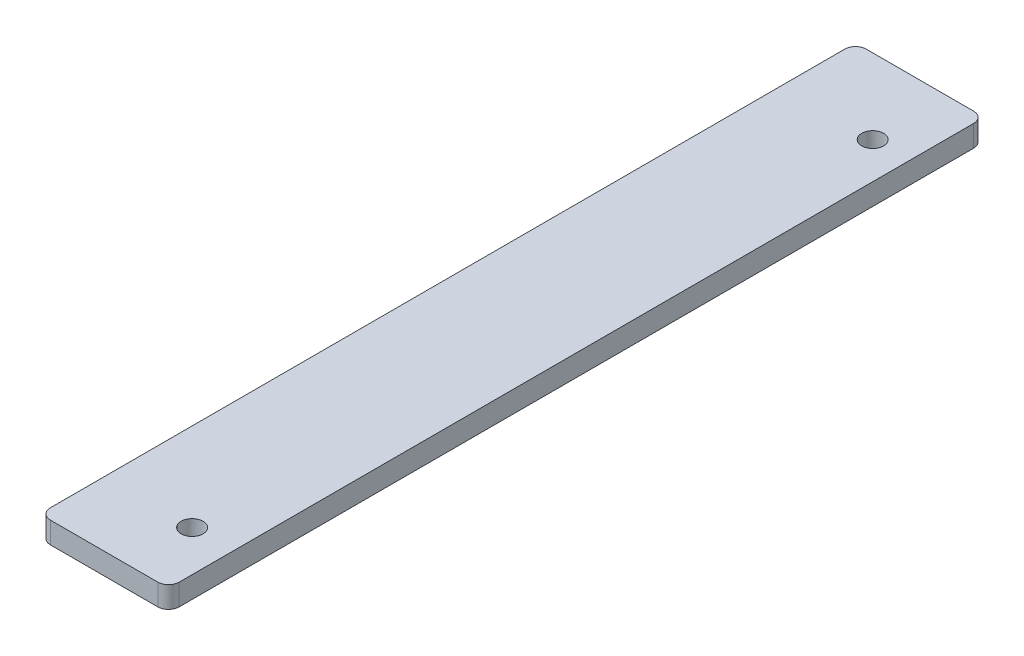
from build123d import *

# Parameters (mm, degrees)
ESQUISSE1_R        = 5.1
BOSS_EXTRU_1_DEPTH = 10


with BuildPart() as part:
    # Esquisse1 → Boss.-Extru.1 (new body)
    with BuildSketch(Plane(origin=(0, 5, 0), x_dir=(1, 0, 0), z_dir=(0, 1, 0))):
        with BuildLine():
            Line((-25, -190), (25, -190))
            ThreePointArc((25, -190), (28.535533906, -188.535533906), (30, -185))
            Line((30, -185), (30, 185))
            ThreePointArc((30, 185), (28.535533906, 188.535533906), (25, 190))
            Line((25, 190), (-25, 190))
            ThreePointArc((-25, 190), (-28.535533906, 188.535533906), (-30, 185))
            Line((-30, 185), (-30, -185))
            ThreePointArc((-30, -185), (-28.535533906, -188.535533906), (-25, -190))
        make_face()
        with Locations(Location((13, 155, 0), (0, 0, 90))):
            Circle(ESQUISSE1_R, mode=Mode.SUBTRACT)
        with Locations(Location((11, -160, 0), (0, 0, 90))):
            Circle(ESQUISSE1_R, mode=Mode.SUBTRACT)
    extrude(amount=-BOSS_EXTRU_1_DEPTH)


solid = part.part
